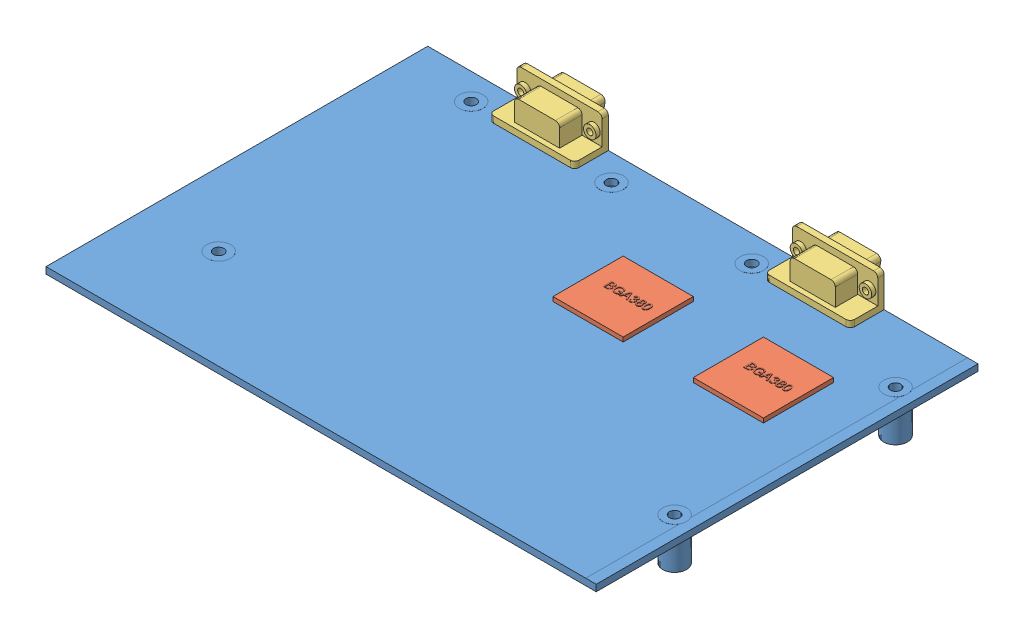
SolidWorks assembly main board-simple.SLDASM, configuration Default (file format 3400). Lengths in mm.
Overall size (199.24 27.62 144.34).
5 component instances, 3 part files, 4 mates.
Components (placement in the parent):
- LINECARD_PCB_BB8_V01-1: LINECARD_PCB_BB8_V01.sldprt [Default] at origin size (199.24 15.09 138.24)
- BGA1X1(Default)-2: BGA1X1(Default).sldprt [Default] at (128.6516 2.3622 55.7784) x (1 0 0) z (0 1 0) size (25.4 25.4 2.68)
- BGA1X1(Default)-3: BGA1X1(Default).sldprt [Default] at (77.8516 2.3622 55.7784) x (1 0 0) z (0 1 0) size (25.4 25.4 2.68)
- SW3dPS-Connector D-Sub 9 pin RA Receptacle-4: SW3dPS-Connector D-Sub 9 pin RA Receptacle.SLDPRT [Default] at (38.8881 2.3622 2.286) x (-1 0 0) z (0 0 -1) size (30.89 12.55 18.34)
- SW3dPS-Connector D-Sub 9 pin RA Receptacle-5: SW3dPS-Connector D-Sub 9 pin RA Receptacle.SLDPRT [Default] at (138.7191 2.3622 2.286) x (-1 0 0) z (0 0 -1) size (30.89 12.55 18.34)
Mates (geometry in assembly coordinates):
- Coincident11: coincident anti-aligned: plane of LINECARD_PCB_BB8_V01-1 through (-172.72 2.3622 0) normal (0 1 0); plane of SW3dPS-Connector D-Sub 9 pin RA Receptacle-4 through (38.8881 2.3622 0) normal (0 -1 0)
- Coincident12: coincident aligned: line of LINECARD_PCB_BB8_V01-1; line of SW3dPS-Connector D-Sub 9 pin RA Receptacle-4
- Coincident13: coincident anti-aligned: plane of LINECARD_PCB_BB8_V01-1 through (-172.72 2.3622 0) normal (0 1 0); plane of SW3dPS-Connector D-Sub 9 pin RA Receptacle-5 through (138.7191 2.3622 0) normal (0 -1 0)
- Coincident14: coincident aligned: line of LINECARD_PCB_BB8_V01-1; line of SW3dPS-Connector D-Sub 9 pin RA Receptacle-5
